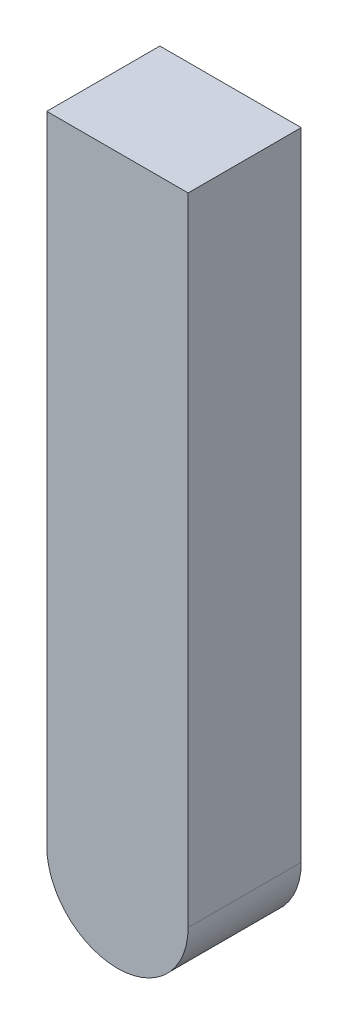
from build123d import *

# Parameters (mm, degrees)
BASE_EXTRUSION_DEPTH = 2


with BuildPart() as part:
    # Esquisse1 → Base-Extrusion (new body)
    with BuildSketch(Plane.XY):
        with BuildLine():
            Line((-1.25, 11.25), (-1.25, 0))
            ThreePointArc((-1.25, 0), (0, -1.25), (1.25, 0))
            Line((1.25, 0), (1.25, 11.25))
            Line((1.25, 11.25), (-1.25, 11.25))
        make_face()
    extrude(amount=BASE_EXTRUSION_DEPTH)


solid = part.part
